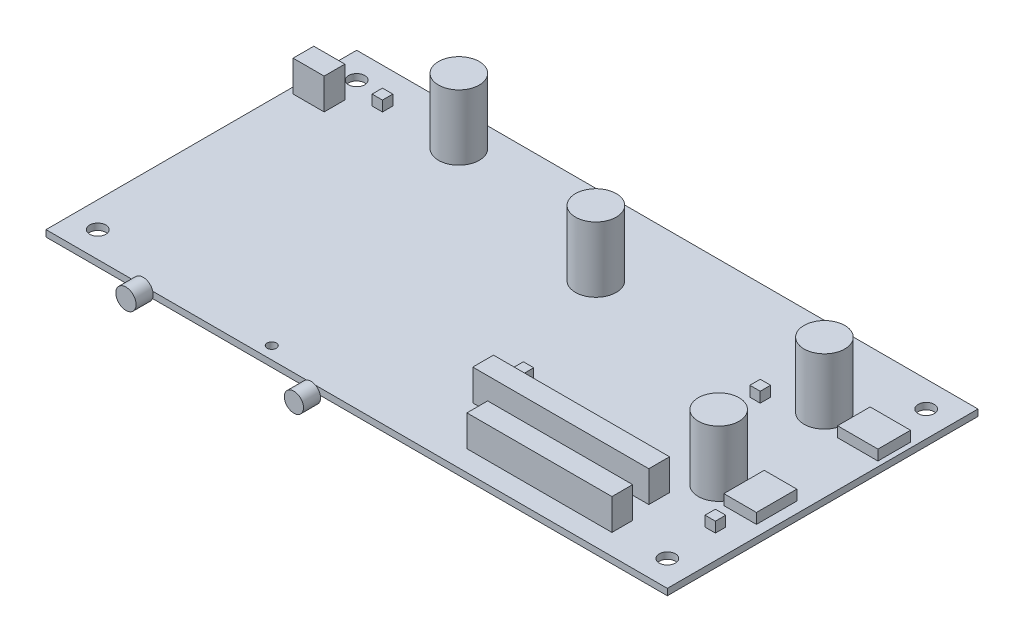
from build123d import *

# Parameters (mm, degrees)
SKETCH1_W          = 152.4
SKETCH1_H          = 76.2
SKETCH1_R          = 1.9812
EXTRUDE1_DEPTH     = 1.5875
EXTRUDE2_START     = 0.889
SKETCH3_R          = 2.4892
EXTRUDE2_DEPTH     = 4.191
EXTRUDE3_START     = 1.27
SKETCH4_R          = 2.3495
EXTRUDE3_DEPTH     = 4.191
SKETCH7_R          = 5
EXTRUDE6_DEPTH     = 16
SKETCH8_R          = 5
EXTRUDE7_DEPTH     = 16
SKETCH9_R          = 5
EXTRUDE8_DEPTH     = 16
SKETCH10_R         = 5
EXTRUDE9_DEPTH     = 16
SKETCH11_R         = 1.1303
CUT_EXTRUDE1_DEPTH = 16
SKETCH12_W         = 35.56
SKETCH12_H         = 5.08
EXTRUDE10_DEPTH    = 7.62
SKETCH13_W         = 43.18
SKETCH13_H         = 5.08
EXTRUDE11_DEPTH    = 7.62
SKETCH14_W         = 7.62
SKETCH14_H         = 5.08
EXTRUDE12_DEPTH    = 7.62
SKETCH18_W         = 9.906
SKETCH18_H         = 8.001
EXTRUDE15_DEPTH    = 2.54
SKETCH19_W         = 8.001
SKETCH19_H         = 9.906
EXTRUDE16_DEPTH    = 2.54
SKETCH20_W         = 2.54
SKETCH20_H         = 2.54
EXTRUDE17_DEPTH    = 2.54
SKETCH21_W         = 2.54
SKETCH21_H         = 2.54
EXTRUDE18_DEPTH    = 2.54
SKETCH22_W         = 2.54
SKETCH22_H         = 2.54
EXTRUDE19_DEPTH    = 2.54
SKETCH23_W         = 2.54
SKETCH23_H         = 2.54
EXTRUDE20_DEPTH    = 2.54


with BuildPart() as part:
    # Sketch1 → Extrude1 (new body)
    with BuildSketch(Plane(origin=(0, 0, 0), x_dir=(1, 0, 0), z_dir=(0, 1, 0))):
        with Locations((76.2, 38.1)):
            Rectangle(SKETCH1_W, SKETCH1_H)
        with Locations(Location((6.35, 69.85, 0), (0, 0, 270))):
            Circle(SKETCH1_R, mode=Mode.SUBTRACT)
        with Locations(Location((146.05, 69.85, 0), (0, 0, 270))):
            Circle(SKETCH1_R, mode=Mode.SUBTRACT)
        with Locations(Location((6.35, 6.35, 0), (0, 0, 270))):
            Circle(SKETCH1_R, mode=Mode.SUBTRACT)
        with Locations(Location((146.05, 6.35, 0), (0, 0, 270))):
            Circle(SKETCH1_R, mode=Mode.SUBTRACT)
    extrude(amount=EXTRUDE1_DEPTH)

    # Sketch7 → Extrude6 (add)
    with BuildSketch(Plane(origin=(0, 1.5875, 0), x_dir=(-1, 0, 0), z_dir=(0, 1, 0))):
        with Locations(Location((-78.2828, -56.5912, 0), (0, 0, 270))):
            Circle(SKETCH7_R)
    extrude(amount=EXTRUDE6_DEPTH)

    # Sketch8 → Extrude7 (add)
    with BuildSketch(Plane(origin=(0, 1.5875, 0), x_dir=(-1, 0, 0), z_dir=(0, 1, 0))):
        with Locations(Location((-136.7028, -28.29814, 0), (0, 0, 270))):
            Circle(SKETCH8_R)
    extrude(amount=EXTRUDE7_DEPTH)

    # Sketch9 → Extrude8 (add)
    with BuildSketch(Plane(origin=(0, 1.5875, 0), x_dir=(-1, 0, 0), z_dir=(0, 1, 0))):
        with Locations(Location((-134.3152, -56.6166, 0), (0, 0, 270))):
            Circle(SKETCH9_R)
    extrude(amount=EXTRUDE8_DEPTH)

    # Sketch10 → Extrude9 (add)
    with BuildSketch(Plane(origin=(0, 1.5875, 0), x_dir=(-1, 0, 0), z_dir=(0, 1, 0))):
        with Locations(Location((-33.4264, -67.8434, 0), (0, 0, 270))):
            Circle(SKETCH10_R)
    extrude(amount=EXTRUDE9_DEPTH)

    # Sketch11 → Cut-Extrude1 (cut)
    with BuildSketch(Plane(origin=(0, 1.5875, 0), x_dir=(-1, 0, 0), z_dir=(0, 1, 0))):
        with Locations(Location((-52.324, -3.048, 0), (0, 0, 90))):
            Circle(SKETCH11_R)
    extrude(amount=-CUT_EXTRUDE1_DEPTH, mode=Mode.SUBTRACT)

    # Sketch12 → Extrude10 (add)
    with BuildSketch(Plane(origin=(0, 1.5875, 0), x_dir=(-1, 0, 0), z_dir=(0, 1, 0))):
        with Locations((-115.951, -7.62)):
            Rectangle(SKETCH12_W, SKETCH12_H)
    extrude(amount=EXTRUDE10_DEPTH)

    # Sketch13 → Extrude11 (add)
    with BuildSketch(Plane(origin=(0, 1.5875, 0), x_dir=(-1, 0, 0), z_dir=(0, 1, 0))):
        with Locations((-110.744, -18.0594)):
            Rectangle(SKETCH13_W, SKETCH13_H)
    extrude(amount=EXTRUDE11_DEPTH)

    # Sketch14 → Extrude12 (add)
    with BuildSketch(Plane(origin=(0, 1.5875, 0), x_dir=(-1, 0, 0), z_dir=(0, 1, 0))):
        with Locations((-5.3086, -61.6458)):
            Rectangle(SKETCH14_W, SKETCH14_H)
    extrude(amount=EXTRUDE12_DEPTH)

    # Sketch18 → Extrude15 (add)
    with BuildSketch(Plane(origin=(0, 1.5875, 0), x_dir=(-1, 0, 0), z_dir=(0, 1, 0))):
        with Locations((-146.2278, -56.8706)):
            Rectangle(SKETCH18_W, SKETCH18_H)
    extrude(amount=EXTRUDE15_DEPTH)

    # Sketch19 → Extrude16 (add)
    with BuildSketch(Plane(origin=(0, 1.5875, 0), x_dir=(-1, 0, 0), z_dir=(0, 1, 0))):
        with Locations((-145.7452, -29.464)):
            Rectangle(SKETCH19_W, SKETCH19_H)
    extrude(amount=EXTRUDE16_DEPTH)

    # Sketch20 → Extrude17 (add)
    with BuildSketch(Plane(origin=(0, 1.5875, 0), x_dir=(-1, 0, 0), z_dir=(0, 1, 0))):
        with Locations((-145.288, -18.8976)):
            Rectangle(SKETCH20_W, SKETCH20_H)
    extrude(amount=EXTRUDE17_DEPTH)

    # Sketch21 → Extrude18 (add)
    with BuildSketch(Plane(origin=(0, 1.5875, 0), x_dir=(-1, 0, 0), z_dir=(0, 1, 0))):
        with Locations((-123.19, -51.9938)):
            Rectangle(SKETCH21_W, SKETCH21_H)
    extrude(amount=EXTRUDE18_DEPTH)

    # Sketch22 → Extrude19 (add)
    with BuildSketch(Plane(origin=(0, 1.5875, 0), x_dir=(-1, 0, 0), z_dir=(0, 1, 0))):
        with Locations((-90.424, -26.67)):
            Rectangle(SKETCH22_W, SKETCH22_H)
    extrude(amount=EXTRUDE19_DEPTH)

    # Sketch23 → Extrude20 (add)
    with BuildSketch(Plane(origin=(0, 1.5875, 0), x_dir=(-1, 0, 0), z_dir=(0, 1, 0))):
        with Locations((-15.0114, -67.5132)):
            Rectangle(SKETCH23_W, SKETCH23_H)
    extrude(amount=EXTRUDE20_DEPTH)


with BuildPart() as body_2:
    # Sketch3 → Extrude2 (new body)
    with BuildSketch(Plane.XY.offset(EXTRUDE2_START)):
        with Locations((24.6888, 1.7907)):
            Circle(SKETCH3_R)
    extrude(amount=EXTRUDE2_DEPTH)


with BuildPart() as body_3:
    # Sketch4 → Extrude3 (new body)
    with BuildSketch(Plane.XY.offset(EXTRUDE3_START)):
        with Locations((66.2686, 0.79375)):
            Circle(SKETCH4_R)
    extrude(amount=EXTRUDE3_DEPTH)


solid = Compound([part.part, body_2.part, body_3.part])
